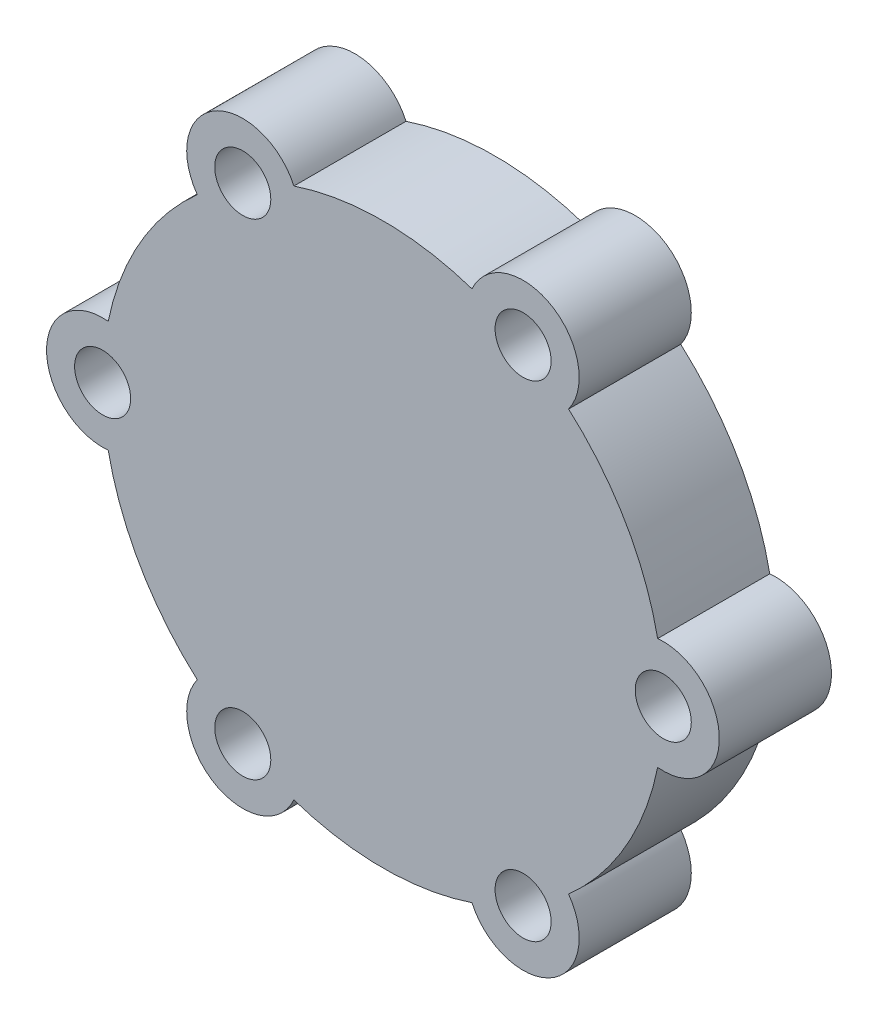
ISO-10303-21;
HEADER;
FILE_DESCRIPTION(('STEP AP214'),'2;1');
FILE_NAME('part.step','',(''),(''),'','','');
FILE_SCHEMA(('AUTOMOTIVE_DESIGN { 1 0 10303 214 1 1 1 1 }'));
ENDSEC;
DATA;
#1=APPLICATION_CONTEXT('core data for automotive mechanical design processes');
#2=APPLICATION_PROTOCOL_DEFINITION('international standard','automotive_design',2000,#1);
#3=PRODUCT_CONTEXT('',#1,'mechanical');
#4=PRODUCT('Part','Part','',(#3));
#5=PRODUCT_RELATED_PRODUCT_CATEGORY('part','',(#4));
#6=PRODUCT_DEFINITION_FORMATION('','',#4);
#7=PRODUCT_DEFINITION_CONTEXT('part definition',#1,'design');
#8=PRODUCT_DEFINITION('design','',#6,#7);
#9=PRODUCT_DEFINITION_SHAPE('','',#8);
#10=(LENGTH_UNIT() NAMED_UNIT(*) SI_UNIT(.MILLI.,.METRE.));
#11=(NAMED_UNIT(*) PLANE_ANGLE_UNIT() SI_UNIT($,.RADIAN.));
#12=(NAMED_UNIT(*) SI_UNIT($,.STERADIAN.) SOLID_ANGLE_UNIT());
#13=UNCERTAINTY_MEASURE_WITH_UNIT(LENGTH_MEASURE(1.E-05),#10,'distance_accuracy_value','');
#14=(GEOMETRIC_REPRESENTATION_CONTEXT(3) GLOBAL_UNCERTAINTY_ASSIGNED_CONTEXT((#13)) GLOBAL_UNIT_ASSIGNED_CONTEXT((#10,
#11,#12)) REPRESENTATION_CONTEXT('',''));
#15=CARTESIAN_POINT('',(0.,0.,0.));
#16=DIRECTION('',(0.,0.,1.));
#17=DIRECTION('',(1.,0.,0.));
#18=AXIS2_PLACEMENT_3D('',#15,#16,#17);
#19=CARTESIAN_POINT('',(95.,70.,20.));
#20=DIRECTION('',(0.,0.,1.));
#21=DIRECTION('',(1.,0.,0.));
#22=AXIS2_PLACEMENT_3D('',#19,#20,#21);
#23=PLANE('',#22);
#24=CARTESIAN_POINT('',(94.9999999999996,26.6987298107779,20.));
#25=DIRECTION('',(0.,0.,1.));
#26=DIRECTION('',(1.,0.,0.));
#27=AXIS2_PLACEMENT_3D('',#24,#25,#26);
#28=CIRCLE('',#27,5.);
#29=CARTESIAN_POINT('',(99.9999999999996,26.6987298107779,20.));
#30=VERTEX_POINT('',#29);
#31=EDGE_CURVE('E348',#30,#30,#28,.T.);
#32=ORIENTED_EDGE('',*,*,#31,.F.);
#33=EDGE_LOOP('',(#32));
#34=FACE_BOUND('',#33,.T.);
#35=CARTESIAN_POINT('',(95.0000000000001,113.301270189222,20.));
#36=DIRECTION('',(0.,0.,1.));
#37=DIRECTION('',(1.,0.,0.));
#38=AXIS2_PLACEMENT_3D('',#35,#36,#37);
#39=CIRCLE('',#38,5.);
#40=CARTESIAN_POINT('',(100.,113.301270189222,20.));
#41=VERTEX_POINT('',#40);
#42=EDGE_CURVE('E364',#41,#41,#39,.T.);
#43=ORIENTED_EDGE('',*,*,#42,.F.);
#44=EDGE_LOOP('',(#43));
#45=FACE_BOUND('',#44,.T.);
#46=CARTESIAN_POINT('',(20.0000000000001,69.9999999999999,20.));
#47=DIRECTION('',(0.,0.,1.));
#48=DIRECTION('',(1.,0.,0.));
#49=AXIS2_PLACEMENT_3D('',#46,#47,#48);
#50=CIRCLE('',#49,5.);
#51=CARTESIAN_POINT('',(25.0000000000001,69.9999999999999,20.));
#52=VERTEX_POINT('',#51);
#53=EDGE_CURVE('E170',#52,#52,#50,.T.);
#54=ORIENTED_EDGE('',*,*,#53,.F.);
#55=EDGE_LOOP('',(#54));
#56=FACE_BOUND('',#55,.T.);
#57=CARTESIAN_POINT('',(70.,70.,20.));
#58=DIRECTION('',(0.,0.,1.));
#59=DIRECTION('',(1.,0.,0.));
#60=AXIS2_PLACEMENT_3D('',#57,#58,#59);
#61=CIRCLE('',#60,50.);
#62=CARTESIAN_POINT('',(103.116843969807,32.5396924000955,20.));
#63=VERTEX_POINT('',#62);
#64=CARTESIAN_POINT('',(119.,60.0501256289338,20.));
#65=VERTEX_POINT('',#64);
#66=EDGE_CURVE('E200',#63,#65,#61,.T.);
#67=ORIENTED_EDGE('',*,*,#66,.T.);
#68=CARTESIAN_POINT('',(120.,70.,20.));
#69=DIRECTION('',(0.,0.,1.));
#70=DIRECTION('',(1.,0.,0.));
#71=AXIS2_PLACEMENT_3D('',#68,#69,#70);
#72=CIRCLE('',#71,9.99999999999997);
#73=CARTESIAN_POINT('',(119.,79.9498743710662,20.));
#74=VERTEX_POINT('',#73);
#75=EDGE_CURVE('E111',#65,#74,#72,.T.);
#76=ORIENTED_EDGE('',*,*,#75,.T.);
#77=CARTESIAN_POINT('',(70.,70.,20.));
#78=DIRECTION('',(0.,0.,1.));
#79=DIRECTION('',(1.,0.,0.));
#80=AXIS2_PLACEMENT_3D('',#77,#78,#79);
#81=CIRCLE('',#80,50.);
#82=CARTESIAN_POINT('',(103.116843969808,107.460307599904,20.));
#83=VERTEX_POINT('',#82);
#84=EDGE_CURVE('E238',#74,#83,#81,.T.);
#85=ORIENTED_EDGE('',*,*,#84,.T.);
#86=CARTESIAN_POINT('',(95.0000000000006,113.301270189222,20.));
#87=DIRECTION('',(0.,0.,1.));
#88=DIRECTION('',(1.,0.,0.));
#89=AXIS2_PLACEMENT_3D('',#86,#87,#88);
#90=CIRCLE('',#89,9.99999999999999);
#91=CARTESIAN_POINT('',(85.8831560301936,117.41018197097,20.));
#92=VERTEX_POINT('',#91);
#93=EDGE_CURVE('E258',#83,#92,#90,.T.);
#94=ORIENTED_EDGE('',*,*,#93,.T.);
#95=CARTESIAN_POINT('',(70.,70.,20.));
#96=DIRECTION('',(0.,0.,1.));
#97=DIRECTION('',(1.,0.,0.));
#98=AXIS2_PLACEMENT_3D('',#95,#96,#97);
#99=CIRCLE('',#98,50.);
#100=CARTESIAN_POINT('',(54.1168439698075,117.410181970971,20.));
#101=VERTEX_POINT('',#100);
#102=EDGE_CURVE('E254',#92,#101,#99,.T.);
#103=ORIENTED_EDGE('',*,*,#102,.T.);
#104=CARTESIAN_POINT('',(45.0000000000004,113.301270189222,20.));
#105=DIRECTION('',(0.,0.,1.));
#106=DIRECTION('',(1.,0.,0.));
#107=AXIS2_PLACEMENT_3D('',#104,#105,#106);
#108=CIRCLE('',#107,9.99999999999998);
#109=CARTESIAN_POINT('',(36.8831560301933,107.460307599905,20.));
#110=VERTEX_POINT('',#109);
#111=EDGE_CURVE('E257',#101,#110,#108,.T.);
#112=ORIENTED_EDGE('',*,*,#111,.T.);
#113=CARTESIAN_POINT('',(70.,70.,20.));
#114=DIRECTION('',(0.,0.,1.));
#115=DIRECTION('',(1.,0.,0.));
#116=AXIS2_PLACEMENT_3D('',#113,#114,#115);
#117=CIRCLE('',#116,50.);
#118=CARTESIAN_POINT('',(21.,79.9498743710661,20.));
#119=VERTEX_POINT('',#118);
#120=EDGE_CURVE('E263',#110,#119,#117,.T.);
#121=ORIENTED_EDGE('',*,*,#120,.T.);
#122=CARTESIAN_POINT('',(20.0000000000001,69.9999999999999,20.));
#123=DIRECTION('',(0.,0.,1.));
#124=DIRECTION('',(1.,0.,0.));
#125=AXIS2_PLACEMENT_3D('',#122,#123,#124);
#126=CIRCLE('',#125,9.99999999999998);
#127=CARTESIAN_POINT('',(21.0000000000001,60.0501256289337,20.));
#128=VERTEX_POINT('',#127);
#129=EDGE_CURVE('E270',#119,#128,#126,.T.);
#130=ORIENTED_EDGE('',*,*,#129,.T.);
#131=CARTESIAN_POINT('',(70.,70.,20.));
#132=DIRECTION('',(0.,0.,1.));
#133=DIRECTION('',(1.,0.,0.));
#134=AXIS2_PLACEMENT_3D('',#131,#132,#133);
#135=CIRCLE('',#134,50.);
#136=CARTESIAN_POINT('',(36.8831560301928,32.5396924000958,20.));
#137=VERTEX_POINT('',#136);
#138=EDGE_CURVE('E142',#128,#137,#135,.T.);
#139=ORIENTED_EDGE('',*,*,#138,.T.);
#140=CARTESIAN_POINT('',(44.9999999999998,26.6987298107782,20.));
#141=DIRECTION('',(0.,0.,1.));
#142=DIRECTION('',(1.,0.,0.));
#143=AXIS2_PLACEMENT_3D('',#140,#141,#142);
#144=CIRCLE('',#143,9.99999999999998);
#145=CARTESIAN_POINT('',(54.1168439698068,22.5898180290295,20.));
#146=VERTEX_POINT('',#145);
#147=EDGE_CURVE('E136',#137,#146,#144,.T.);
#148=ORIENTED_EDGE('',*,*,#147,.T.);
#149=CARTESIAN_POINT('',(70.,70.,20.));
#150=DIRECTION('',(0.,0.,1.));
#151=DIRECTION('',(1.,0.,0.));
#152=AXIS2_PLACEMENT_3D('',#149,#150,#151);
#153=CIRCLE('',#152,50.);
#154=CARTESIAN_POINT('',(85.8831560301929,22.5898180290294,20.));
#155=VERTEX_POINT('',#154);
#156=EDGE_CURVE('E140',#146,#155,#153,.T.);
#157=ORIENTED_EDGE('',*,*,#156,.T.);
#158=CARTESIAN_POINT('',(94.9999999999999,26.698729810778,20.));
#159=DIRECTION('',(0.,0.,1.));
#160=DIRECTION('',(1.,0.,0.));
#161=AXIS2_PLACEMENT_3D('',#158,#159,#160);
#162=CIRCLE('',#161,9.99999999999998);
#163=EDGE_CURVE('E56',#155,#63,#162,.T.);
#164=ORIENTED_EDGE('',*,*,#163,.T.);
#165=EDGE_LOOP('',(#67,#76,#85,#94,#103,#112,#121,#130,#139,#148,#157,#164));
#166=FACE_BOUND('',#165,.T.);
#167=CARTESIAN_POINT('',(45.,113.301270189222,20.));
#168=DIRECTION('',(0.,0.,1.));
#169=DIRECTION('',(1.,0.,0.));
#170=AXIS2_PLACEMENT_3D('',#167,#168,#169);
#171=CIRCLE('',#170,5.00000000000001);
#172=CARTESIAN_POINT('',(50.0000000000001,113.301270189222,20.));
#173=VERTEX_POINT('',#172);
#174=EDGE_CURVE('E372',#173,#173,#171,.T.);
#175=ORIENTED_EDGE('',*,*,#174,.F.);
#176=EDGE_LOOP('',(#175));
#177=FACE_BOUND('',#176,.T.);
#178=CARTESIAN_POINT('',(120.,69.9999999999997,20.));
#179=DIRECTION('',(0.,0.,1.));
#180=DIRECTION('',(1.,0.,0.));
#181=AXIS2_PLACEMENT_3D('',#178,#179,#180);
#182=CIRCLE('',#181,5.00000000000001);
#183=CARTESIAN_POINT('',(125.,69.9999999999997,20.));
#184=VERTEX_POINT('',#183);
#185=EDGE_CURVE('E356',#184,#184,#182,.T.);
#186=ORIENTED_EDGE('',*,*,#185,.F.);
#187=EDGE_LOOP('',(#186));
#188=FACE_BOUND('',#187,.T.);
#189=CARTESIAN_POINT('',(44.9999999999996,26.6987298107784,20.));
#190=DIRECTION('',(0.,0.,1.));
#191=DIRECTION('',(1.,0.,0.));
#192=AXIS2_PLACEMENT_3D('',#189,#190,#191);
#193=CIRCLE('',#192,5.);
#194=CARTESIAN_POINT('',(49.9999999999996,26.6987298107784,20.));
#195=VERTEX_POINT('',#194);
#196=EDGE_CURVE('E336',#195,#195,#193,.T.);
#197=ORIENTED_EDGE('',*,*,#196,.F.);
#198=EDGE_LOOP('',(#197));
#199=FACE_BOUND('',#198,.T.);
#200=ADVANCED_FACE('F38',(#34,#45,#56,#166,#177,#188,#199),#23,.T.);
#201=CARTESIAN_POINT('',(95.,70.,0.));
#202=DIRECTION('',(0.,0.,1.));
#203=DIRECTION('',(1.,0.,0.));
#204=AXIS2_PLACEMENT_3D('',#201,#202,#203);
#205=PLANE('',#204);
#206=CARTESIAN_POINT('',(70.,70.,0.));
#207=DIRECTION('',(0.,0.,1.));
#208=DIRECTION('',(1.,0.,0.));
#209=AXIS2_PLACEMENT_3D('',#206,#207,#208);
#210=CIRCLE('',#209,50.);
#211=CARTESIAN_POINT('',(103.116843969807,32.5396924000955,0.));
#212=VERTEX_POINT('',#211);
#213=CARTESIAN_POINT('',(119.,60.0501256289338,0.));
#214=VERTEX_POINT('',#213);
#215=EDGE_CURVE('E165',#212,#214,#210,.T.);
#216=ORIENTED_EDGE('',*,*,#215,.F.);
#217=CARTESIAN_POINT('',(94.9999999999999,26.698729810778,0.));
#218=DIRECTION('',(0.,0.,1.));
#219=DIRECTION('',(1.,0.,0.));
#220=AXIS2_PLACEMENT_3D('',#217,#218,#219);
#221=CIRCLE('',#220,9.99999999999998);
#222=CARTESIAN_POINT('',(85.8831560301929,22.5898180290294,0.));
#223=VERTEX_POINT('',#222);
#224=EDGE_CURVE('E103',#223,#212,#221,.T.);
#225=ORIENTED_EDGE('',*,*,#224,.F.);
#226=CARTESIAN_POINT('',(70.,70.,0.));
#227=DIRECTION('',(0.,0.,1.));
#228=DIRECTION('',(1.,0.,0.));
#229=AXIS2_PLACEMENT_3D('',#226,#227,#228);
#230=CIRCLE('',#229,50.);
#231=CARTESIAN_POINT('',(54.1168439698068,22.5898180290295,0.));
#232=VERTEX_POINT('',#231);
#233=EDGE_CURVE('E97',#232,#223,#230,.T.);
#234=ORIENTED_EDGE('',*,*,#233,.F.);
#235=CARTESIAN_POINT('',(44.9999999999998,26.6987298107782,0.));
#236=DIRECTION('',(0.,0.,1.));
#237=DIRECTION('',(1.,0.,0.));
#238=AXIS2_PLACEMENT_3D('',#235,#236,#237);
#239=CIRCLE('',#238,9.99999999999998);
#240=CARTESIAN_POINT('',(36.8831560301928,32.5396924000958,0.));
#241=VERTEX_POINT('',#240);
#242=EDGE_CURVE('E151',#241,#232,#239,.T.);
#243=ORIENTED_EDGE('',*,*,#242,.F.);
#244=CARTESIAN_POINT('',(70.,70.,0.));
#245=DIRECTION('',(0.,0.,1.));
#246=DIRECTION('',(1.,0.,0.));
#247=AXIS2_PLACEMENT_3D('',#244,#245,#246);
#248=CIRCLE('',#247,50.);
#249=CARTESIAN_POINT('',(21.0000000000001,60.0501256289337,0.));
#250=VERTEX_POINT('',#249);
#251=EDGE_CURVE('E191',#250,#241,#248,.T.);
#252=ORIENTED_EDGE('',*,*,#251,.F.);
#253=CARTESIAN_POINT('',(20.0000000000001,69.9999999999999,0.));
#254=DIRECTION('',(0.,0.,1.));
#255=DIRECTION('',(1.,0.,0.));
#256=AXIS2_PLACEMENT_3D('',#253,#254,#255);
#257=CIRCLE('',#256,9.99999999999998);
#258=CARTESIAN_POINT('',(21.,79.9498743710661,0.));
#259=VERTEX_POINT('',#258);
#260=EDGE_CURVE('E188',#259,#250,#257,.T.);
#261=ORIENTED_EDGE('',*,*,#260,.F.);
#262=CARTESIAN_POINT('',(70.,70.,0.));
#263=DIRECTION('',(0.,0.,1.));
#264=DIRECTION('',(1.,0.,0.));
#265=AXIS2_PLACEMENT_3D('',#262,#263,#264);
#266=CIRCLE('',#265,50.);
#267=CARTESIAN_POINT('',(36.8831560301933,107.460307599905,0.));
#268=VERTEX_POINT('',#267);
#269=EDGE_CURVE('E185',#268,#259,#266,.T.);
#270=ORIENTED_EDGE('',*,*,#269,.F.);
#271=CARTESIAN_POINT('',(45.0000000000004,113.301270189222,0.));
#272=DIRECTION('',(0.,0.,1.));
#273=DIRECTION('',(1.,0.,0.));
#274=AXIS2_PLACEMENT_3D('',#271,#272,#273);
#275=CIRCLE('',#274,9.99999999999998);
#276=CARTESIAN_POINT('',(54.1168439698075,117.410181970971,0.));
#277=VERTEX_POINT('',#276);
#278=EDGE_CURVE('E182',#277,#268,#275,.T.);
#279=ORIENTED_EDGE('',*,*,#278,.F.);
#280=CARTESIAN_POINT('',(70.,70.,0.));
#281=DIRECTION('',(0.,0.,1.));
#282=DIRECTION('',(1.,0.,0.));
#283=AXIS2_PLACEMENT_3D('',#280,#281,#282);
#284=CIRCLE('',#283,50.);
#285=CARTESIAN_POINT('',(85.8831560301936,117.41018197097,0.));
#286=VERTEX_POINT('',#285);
#287=EDGE_CURVE('E179',#286,#277,#284,.T.);
#288=ORIENTED_EDGE('',*,*,#287,.F.);
#289=CARTESIAN_POINT('',(95.0000000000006,113.301270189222,0.));
#290=DIRECTION('',(0.,0.,1.));
#291=DIRECTION('',(1.,0.,0.));
#292=AXIS2_PLACEMENT_3D('',#289,#290,#291);
#293=CIRCLE('',#292,9.99999999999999);
#294=CARTESIAN_POINT('',(103.116843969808,107.460307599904,0.));
#295=VERTEX_POINT('',#294);
#296=EDGE_CURVE('E176',#295,#286,#293,.T.);
#297=ORIENTED_EDGE('',*,*,#296,.F.);
#298=CARTESIAN_POINT('',(70.,70.,0.));
#299=DIRECTION('',(0.,0.,1.));
#300=DIRECTION('',(1.,0.,0.));
#301=AXIS2_PLACEMENT_3D('',#298,#299,#300);
#302=CIRCLE('',#301,50.);
#303=CARTESIAN_POINT('',(119.,79.9498743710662,0.));
#304=VERTEX_POINT('',#303);
#305=EDGE_CURVE('E173',#304,#295,#302,.T.);
#306=ORIENTED_EDGE('',*,*,#305,.F.);
#307=CARTESIAN_POINT('',(120.,70.,0.));
#308=DIRECTION('',(0.,0.,1.));
#309=DIRECTION('',(1.,0.,0.));
#310=AXIS2_PLACEMENT_3D('',#307,#308,#309);
#311=CIRCLE('',#310,9.99999999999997);
#312=EDGE_CURVE('E169',#214,#304,#311,.T.);
#313=ORIENTED_EDGE('',*,*,#312,.F.);
#314=EDGE_LOOP('',(#216,#225,#234,#243,#252,#261,#270,#279,#288,#297,#306,#313));
#315=FACE_BOUND('',#314,.T.);
#316=CARTESIAN_POINT('',(20.0000000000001,69.9999999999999,0.));
#317=DIRECTION('',(0.,0.,1.));
#318=DIRECTION('',(1.,0.,0.));
#319=AXIS2_PLACEMENT_3D('',#316,#317,#318);
#320=CIRCLE('',#319,5.);
#321=CARTESIAN_POINT('',(25.0000000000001,69.9999999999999,0.));
#322=VERTEX_POINT('',#321);
#323=EDGE_CURVE('E376',#322,#322,#320,.T.);
#324=ORIENTED_EDGE('',*,*,#323,.T.);
#325=EDGE_LOOP('',(#324));
#326=FACE_BOUND('',#325,.T.);
#327=CARTESIAN_POINT('',(45.,113.301270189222,0.));
#328=DIRECTION('',(0.,0.,1.));
#329=DIRECTION('',(1.,0.,0.));
#330=AXIS2_PLACEMENT_3D('',#327,#328,#329);
#331=CIRCLE('',#330,5.00000000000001);
#332=CARTESIAN_POINT('',(50.0000000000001,113.301270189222,0.));
#333=VERTEX_POINT('',#332);
#334=EDGE_CURVE('E368',#333,#333,#331,.T.);
#335=ORIENTED_EDGE('',*,*,#334,.T.);
#336=EDGE_LOOP('',(#335));
#337=FACE_BOUND('',#336,.T.);
#338=CARTESIAN_POINT('',(95.0000000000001,113.301270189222,0.));
#339=DIRECTION('',(0.,0.,1.));
#340=DIRECTION('',(1.,0.,0.));
#341=AXIS2_PLACEMENT_3D('',#338,#339,#340);
#342=CIRCLE('',#341,5.);
#343=CARTESIAN_POINT('',(100.,113.301270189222,0.));
#344=VERTEX_POINT('',#343);
#345=EDGE_CURVE('E360',#344,#344,#342,.T.);
#346=ORIENTED_EDGE('',*,*,#345,.T.);
#347=EDGE_LOOP('',(#346));
#348=FACE_BOUND('',#347,.T.);
#349=CARTESIAN_POINT('',(120.,69.9999999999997,0.));
#350=DIRECTION('',(0.,0.,1.));
#351=DIRECTION('',(1.,0.,0.));
#352=AXIS2_PLACEMENT_3D('',#349,#350,#351);
#353=CIRCLE('',#352,5.00000000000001);
#354=CARTESIAN_POINT('',(125.,69.9999999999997,0.));
#355=VERTEX_POINT('',#354);
#356=EDGE_CURVE('E352',#355,#355,#353,.T.);
#357=ORIENTED_EDGE('',*,*,#356,.T.);
#358=EDGE_LOOP('',(#357));
#359=FACE_BOUND('',#358,.T.);
#360=CARTESIAN_POINT('',(94.9999999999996,26.6987298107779,0.));
#361=DIRECTION('',(0.,0.,1.));
#362=DIRECTION('',(1.,0.,0.));
#363=AXIS2_PLACEMENT_3D('',#360,#361,#362);
#364=CIRCLE('',#363,5.);
#365=CARTESIAN_POINT('',(99.9999999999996,26.6987298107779,0.));
#366=VERTEX_POINT('',#365);
#367=EDGE_CURVE('E345',#366,#366,#364,.T.);
#368=ORIENTED_EDGE('',*,*,#367,.T.);
#369=EDGE_LOOP('',(#368));
#370=FACE_BOUND('',#369,.T.);
#371=CARTESIAN_POINT('',(44.9999999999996,26.6987298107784,0.));
#372=DIRECTION('',(0.,0.,1.));
#373=DIRECTION('',(1.,0.,0.));
#374=AXIS2_PLACEMENT_3D('',#371,#372,#373);
#375=CIRCLE('',#374,5.);
#376=CARTESIAN_POINT('',(49.9999999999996,26.6987298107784,0.));
#377=VERTEX_POINT('',#376);
#378=EDGE_CURVE('E339',#377,#377,#375,.T.);
#379=ORIENTED_EDGE('',*,*,#378,.T.);
#380=EDGE_LOOP('',(#379));
#381=FACE_BOUND('',#380,.T.);
#382=ADVANCED_FACE('F242',(#315,#326,#337,#348,#359,#370,#381),#205,.F.);
#383=CARTESIAN_POINT('',(70.,70.,20.));
#384=DIRECTION('',(0.,0.,-1.));
#385=DIRECTION('',(-1.,0.,0.));
#386=AXIS2_PLACEMENT_3D('',#383,#384,#385);
#387=CYLINDRICAL_SURFACE('',#386,50.);
#388=ORIENTED_EDGE('',*,*,#215,.T.);
#389=DIRECTION('',(0.,0.,-1.));
#390=VECTOR('',#389,1.);
#391=CARTESIAN_POINT('',(119.,60.0501256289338,20.));
#392=LINE('',#391,#390);
#393=EDGE_CURVE('E11',#65,#214,#392,.T.);
#394=ORIENTED_EDGE('',*,*,#393,.F.);
#395=ORIENTED_EDGE('',*,*,#66,.F.);
#396=DIRECTION('',(0.,0.,-1.));
#397=VECTOR('',#396,1.);
#398=CARTESIAN_POINT('',(103.116843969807,32.5396924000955,20.));
#399=LINE('',#398,#397);
#400=EDGE_CURVE('E161',#63,#212,#399,.T.);
#401=ORIENTED_EDGE('',*,*,#400,.T.);
#402=EDGE_LOOP('',(#388,#394,#395,#401));
#403=FACE_BOUND('',#402,.T.);
#404=ADVANCED_FACE('F40',(#403),#387,.T.);
#405=CARTESIAN_POINT('',(120.,70.,20.));
#406=DIRECTION('',(0.,0.,-1.));
#407=DIRECTION('',(-1.,0.,0.));
#408=AXIS2_PLACEMENT_3D('',#405,#406,#407);
#409=CYLINDRICAL_SURFACE('',#408,9.99999999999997);
#410=ORIENTED_EDGE('',*,*,#312,.T.);
#411=DIRECTION('',(0.,0.,-1.));
#412=VECTOR('',#411,1.);
#413=CARTESIAN_POINT('',(119.,79.9498743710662,20.));
#414=LINE('',#413,#412);
#415=EDGE_CURVE('E48',#74,#304,#414,.T.);
#416=ORIENTED_EDGE('',*,*,#415,.F.);
#417=ORIENTED_EDGE('',*,*,#75,.F.);
#418=ORIENTED_EDGE('',*,*,#393,.T.);
#419=EDGE_LOOP('',(#410,#416,#417,#418));
#420=FACE_BOUND('',#419,.T.);
#421=ADVANCED_FACE('F537',(#420),#409,.T.);
#422=CARTESIAN_POINT('',(70.,70.,20.));
#423=DIRECTION('',(0.,0.,-1.));
#424=DIRECTION('',(-1.,0.,0.));
#425=AXIS2_PLACEMENT_3D('',#422,#423,#424);
#426=CYLINDRICAL_SURFACE('',#425,50.);
#427=ORIENTED_EDGE('',*,*,#305,.T.);
#428=DIRECTION('',(0.,0.,-1.));
#429=VECTOR('',#428,1.);
#430=CARTESIAN_POINT('',(103.116843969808,107.460307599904,20.));
#431=LINE('',#430,#429);
#432=EDGE_CURVE('E227',#83,#295,#431,.T.);
#433=ORIENTED_EDGE('',*,*,#432,.F.);
#434=ORIENTED_EDGE('',*,*,#84,.F.);
#435=ORIENTED_EDGE('',*,*,#415,.T.);
#436=EDGE_LOOP('',(#427,#433,#434,#435));
#437=FACE_BOUND('',#436,.T.);
#438=ADVANCED_FACE('F236',(#437),#426,.T.);
#439=CARTESIAN_POINT('',(95.0000000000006,113.301270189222,20.));
#440=DIRECTION('',(0.,0.,-1.));
#441=DIRECTION('',(-1.,0.,0.));
#442=AXIS2_PLACEMENT_3D('',#439,#440,#441);
#443=CYLINDRICAL_SURFACE('',#442,9.99999999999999);
#444=ORIENTED_EDGE('',*,*,#296,.T.);
#445=DIRECTION('',(0.,0.,-1.));
#446=VECTOR('',#445,1.);
#447=CARTESIAN_POINT('',(85.8831560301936,117.41018197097,20.));
#448=LINE('',#447,#446);
#449=EDGE_CURVE('E223',#92,#286,#448,.T.);
#450=ORIENTED_EDGE('',*,*,#449,.F.);
#451=ORIENTED_EDGE('',*,*,#93,.F.);
#452=ORIENTED_EDGE('',*,*,#432,.T.);
#453=EDGE_LOOP('',(#444,#450,#451,#452));
#454=FACE_BOUND('',#453,.T.);
#455=ADVANCED_FACE('F248',(#454),#443,.T.);
#456=CARTESIAN_POINT('',(70.,70.,20.));
#457=DIRECTION('',(0.,0.,-1.));
#458=DIRECTION('',(-1.,0.,0.));
#459=AXIS2_PLACEMENT_3D('',#456,#457,#458);
#460=CYLINDRICAL_SURFACE('',#459,50.);
#461=ORIENTED_EDGE('',*,*,#287,.T.);
#462=DIRECTION('',(0.,0.,-1.));
#463=VECTOR('',#462,1.);
#464=CARTESIAN_POINT('',(54.1168439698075,117.410181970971,20.));
#465=LINE('',#464,#463);
#466=EDGE_CURVE('E219',#101,#277,#465,.T.);
#467=ORIENTED_EDGE('',*,*,#466,.F.);
#468=ORIENTED_EDGE('',*,*,#102,.F.);
#469=ORIENTED_EDGE('',*,*,#449,.T.);
#470=EDGE_LOOP('',(#461,#467,#468,#469));
#471=FACE_BOUND('',#470,.T.);
#472=ADVANCED_FACE('F252',(#471),#460,.T.);
#473=CARTESIAN_POINT('',(45.0000000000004,113.301270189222,20.));
#474=DIRECTION('',(0.,0.,-1.));
#475=DIRECTION('',(-1.,0.,0.));
#476=AXIS2_PLACEMENT_3D('',#473,#474,#475);
#477=CYLINDRICAL_SURFACE('',#476,9.99999999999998);
#478=ORIENTED_EDGE('',*,*,#278,.T.);
#479=DIRECTION('',(0.,0.,-1.));
#480=VECTOR('',#479,1.);
#481=CARTESIAN_POINT('',(36.8831560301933,107.460307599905,20.));
#482=LINE('',#481,#480);
#483=EDGE_CURVE('E215',#110,#268,#482,.T.);
#484=ORIENTED_EDGE('',*,*,#483,.F.);
#485=ORIENTED_EDGE('',*,*,#111,.F.);
#486=ORIENTED_EDGE('',*,*,#466,.T.);
#487=EDGE_LOOP('',(#478,#484,#485,#486));
#488=FACE_BOUND('',#487,.T.);
#489=ADVANCED_FACE('F502',(#488),#477,.T.);
#490=CARTESIAN_POINT('',(70.,70.,20.));
#491=DIRECTION('',(0.,0.,-1.));
#492=DIRECTION('',(-1.,0.,0.));
#493=AXIS2_PLACEMENT_3D('',#490,#491,#492);
#494=CYLINDRICAL_SURFACE('',#493,50.);
#495=ORIENTED_EDGE('',*,*,#269,.T.);
#496=DIRECTION('',(0.,0.,-1.));
#497=VECTOR('',#496,1.);
#498=CARTESIAN_POINT('',(21.,79.9498743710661,20.));
#499=LINE('',#498,#497);
#500=EDGE_CURVE('E211',#119,#259,#499,.T.);
#501=ORIENTED_EDGE('',*,*,#500,.F.);
#502=ORIENTED_EDGE('',*,*,#120,.F.);
#503=ORIENTED_EDGE('',*,*,#483,.T.);
#504=EDGE_LOOP('',(#495,#501,#502,#503));
#505=FACE_BOUND('',#504,.T.);
#506=ADVANCED_FACE('F493',(#505),#494,.T.);
#507=CARTESIAN_POINT('',(20.0000000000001,69.9999999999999,20.));
#508=DIRECTION('',(0.,0.,-1.));
#509=DIRECTION('',(-1.,0.,0.));
#510=AXIS2_PLACEMENT_3D('',#507,#508,#509);
#511=CYLINDRICAL_SURFACE('',#510,9.99999999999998);
#512=ORIENTED_EDGE('',*,*,#260,.T.);
#513=DIRECTION('',(0.,0.,-1.));
#514=VECTOR('',#513,1.);
#515=CARTESIAN_POINT('',(21.0000000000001,60.0501256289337,20.));
#516=LINE('',#515,#514);
#517=EDGE_CURVE('E207',#128,#250,#516,.T.);
#518=ORIENTED_EDGE('',*,*,#517,.F.);
#519=ORIENTED_EDGE('',*,*,#129,.F.);
#520=ORIENTED_EDGE('',*,*,#500,.T.);
#521=EDGE_LOOP('',(#512,#518,#519,#520));
#522=FACE_BOUND('',#521,.T.);
#523=ADVANCED_FACE('F283',(#522),#511,.T.);
#524=CARTESIAN_POINT('',(70.,70.,20.));
#525=DIRECTION('',(0.,0.,-1.));
#526=DIRECTION('',(-1.,0.,0.));
#527=AXIS2_PLACEMENT_3D('',#524,#525,#526);
#528=CYLINDRICAL_SURFACE('',#527,50.);
#529=ORIENTED_EDGE('',*,*,#251,.T.);
#530=DIRECTION('',(0.,0.,-1.));
#531=VECTOR('',#530,1.);
#532=CARTESIAN_POINT('',(36.8831560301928,32.5396924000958,20.));
#533=LINE('',#532,#531);
#534=EDGE_CURVE('E153',#137,#241,#533,.T.);
#535=ORIENTED_EDGE('',*,*,#534,.F.);
#536=ORIENTED_EDGE('',*,*,#138,.F.);
#537=ORIENTED_EDGE('',*,*,#517,.T.);
#538=EDGE_LOOP('',(#529,#535,#536,#537));
#539=FACE_BOUND('',#538,.T.);
#540=ADVANCED_FACE('F287',(#539),#528,.T.);
#541=CARTESIAN_POINT('',(44.9999999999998,26.6987298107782,20.));
#542=DIRECTION('',(0.,0.,-1.));
#543=DIRECTION('',(-1.,0.,0.));
#544=AXIS2_PLACEMENT_3D('',#541,#542,#543);
#545=CYLINDRICAL_SURFACE('',#544,9.99999999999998);
#546=ORIENTED_EDGE('',*,*,#242,.T.);
#547=DIRECTION('',(0.,0.,-1.));
#548=VECTOR('',#547,1.);
#549=CARTESIAN_POINT('',(54.1168439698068,22.5898180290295,20.));
#550=LINE('',#549,#548);
#551=EDGE_CURVE('E148',#146,#232,#550,.T.);
#552=ORIENTED_EDGE('',*,*,#551,.F.);
#553=ORIENTED_EDGE('',*,*,#147,.F.);
#554=ORIENTED_EDGE('',*,*,#534,.T.);
#555=EDGE_LOOP('',(#546,#552,#553,#554));
#556=FACE_BOUND('',#555,.T.);
#557=ADVANCED_FACE('F149',(#556),#545,.T.);
#558=CARTESIAN_POINT('',(70.,70.,20.));
#559=DIRECTION('',(0.,0.,-1.));
#560=DIRECTION('',(-1.,0.,0.));
#561=AXIS2_PLACEMENT_3D('',#558,#559,#560);
#562=CYLINDRICAL_SURFACE('',#561,50.);
#563=ORIENTED_EDGE('',*,*,#233,.T.);
#564=DIRECTION('',(0.,0.,-1.));
#565=VECTOR('',#564,1.);
#566=CARTESIAN_POINT('',(85.8831560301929,22.5898180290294,20.));
#567=LINE('',#566,#565);
#568=EDGE_CURVE('E154',#155,#223,#567,.T.);
#569=ORIENTED_EDGE('',*,*,#568,.F.);
#570=ORIENTED_EDGE('',*,*,#156,.F.);
#571=ORIENTED_EDGE('',*,*,#551,.T.);
#572=EDGE_LOOP('',(#563,#569,#570,#571));
#573=FACE_BOUND('',#572,.T.);
#574=ADVANCED_FACE('F156',(#573),#562,.T.);
#575=CARTESIAN_POINT('',(94.9999999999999,26.698729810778,20.));
#576=DIRECTION('',(0.,0.,-1.));
#577=DIRECTION('',(-1.,0.,0.));
#578=AXIS2_PLACEMENT_3D('',#575,#576,#577);
#579=CYLINDRICAL_SURFACE('',#578,9.99999999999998);
#580=ORIENTED_EDGE('',*,*,#224,.T.);
#581=ORIENTED_EDGE('',*,*,#400,.F.);
#582=ORIENTED_EDGE('',*,*,#163,.F.);
#583=ORIENTED_EDGE('',*,*,#568,.T.);
#584=EDGE_LOOP('',(#580,#581,#582,#583));
#585=FACE_BOUND('',#584,.T.);
#586=ADVANCED_FACE('F291',(#585),#579,.T.);
#587=CARTESIAN_POINT('',(20.0000000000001,69.9999999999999,20.));
#588=DIRECTION('',(0.,0.,-1.));
#589=DIRECTION('',(-1.,0.,0.));
#590=AXIS2_PLACEMENT_3D('',#587,#588,#589);
#591=CYLINDRICAL_SURFACE('',#590,5.);
#592=ORIENTED_EDGE('',*,*,#53,.T.);
#593=EDGE_LOOP('',(#592));
#594=FACE_BOUND('',#593,.T.);
#595=ORIENTED_EDGE('',*,*,#323,.F.);
#596=EDGE_LOOP('',(#595));
#597=FACE_BOUND('',#596,.T.);
#598=ADVANCED_FACE('F293',(#594,#597),#591,.F.);
#599=CARTESIAN_POINT('',(45.,113.301270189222,20.));
#600=DIRECTION('',(0.,0.,-1.));
#601=DIRECTION('',(-1.,0.,0.));
#602=AXIS2_PLACEMENT_3D('',#599,#600,#601);
#603=CYLINDRICAL_SURFACE('',#602,5.00000000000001);
#604=ORIENTED_EDGE('',*,*,#174,.T.);
#605=EDGE_LOOP('',(#604));
#606=FACE_BOUND('',#605,.T.);
#607=ORIENTED_EDGE('',*,*,#334,.F.);
#608=EDGE_LOOP('',(#607));
#609=FACE_BOUND('',#608,.T.);
#610=ADVANCED_FACE('F299',(#606,#609),#603,.F.);
#611=CARTESIAN_POINT('',(95.0000000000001,113.301270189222,20.));
#612=DIRECTION('',(0.,0.,-1.));
#613=DIRECTION('',(-1.,0.,0.));
#614=AXIS2_PLACEMENT_3D('',#611,#612,#613);
#615=CYLINDRICAL_SURFACE('',#614,5.);
#616=ORIENTED_EDGE('',*,*,#42,.T.);
#617=EDGE_LOOP('',(#616));
#618=FACE_BOUND('',#617,.T.);
#619=ORIENTED_EDGE('',*,*,#345,.F.);
#620=EDGE_LOOP('',(#619));
#621=FACE_BOUND('',#620,.T.);
#622=ADVANCED_FACE('F315',(#618,#621),#615,.F.);
#623=CARTESIAN_POINT('',(120.,69.9999999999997,20.));
#624=DIRECTION('',(0.,0.,-1.));
#625=DIRECTION('',(-1.,0.,0.));
#626=AXIS2_PLACEMENT_3D('',#623,#624,#625);
#627=CYLINDRICAL_SURFACE('',#626,5.00000000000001);
#628=ORIENTED_EDGE('',*,*,#185,.T.);
#629=EDGE_LOOP('',(#628));
#630=FACE_BOUND('',#629,.T.);
#631=ORIENTED_EDGE('',*,*,#356,.F.);
#632=EDGE_LOOP('',(#631));
#633=FACE_BOUND('',#632,.T.);
#634=ADVANCED_FACE('F319',(#630,#633),#627,.F.);
#635=CARTESIAN_POINT('',(94.9999999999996,26.6987298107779,20.));
#636=DIRECTION('',(0.,0.,-1.));
#637=DIRECTION('',(-1.,0.,0.));
#638=AXIS2_PLACEMENT_3D('',#635,#636,#637);
#639=CYLINDRICAL_SURFACE('',#638,5.);
#640=ORIENTED_EDGE('',*,*,#31,.T.);
#641=EDGE_LOOP('',(#640));
#642=FACE_BOUND('',#641,.T.);
#643=ORIENTED_EDGE('',*,*,#367,.F.);
#644=EDGE_LOOP('',(#643));
#645=FACE_BOUND('',#644,.T.);
#646=ADVANCED_FACE('F323',(#642,#645),#639,.F.);
#647=CARTESIAN_POINT('',(44.9999999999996,26.6987298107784,20.));
#648=DIRECTION('',(0.,0.,-1.));
#649=DIRECTION('',(-1.,0.,0.));
#650=AXIS2_PLACEMENT_3D('',#647,#648,#649);
#651=CYLINDRICAL_SURFACE('',#650,5.);
#652=ORIENTED_EDGE('',*,*,#196,.T.);
#653=EDGE_LOOP('',(#652));
#654=FACE_BOUND('',#653,.T.);
#655=ORIENTED_EDGE('',*,*,#378,.F.);
#656=EDGE_LOOP('',(#655));
#657=FACE_BOUND('',#656,.T.);
#658=ADVANCED_FACE('F327',(#654,#657),#651,.F.);
#659=CLOSED_SHELL('',(#200,#382,#404,#421,#438,#455,#472,#489,#506,#523,#540,#557,#574,#586,
#598,#610,#622,#634,#646,#658));
#660=MANIFOLD_SOLID_BREP('B2',#659);
#661=ADVANCED_BREP_SHAPE_REPRESENTATION('',(#18,#660),#14);
#662=SHAPE_DEFINITION_REPRESENTATION(#9,#661);
ENDSEC;
END-ISO-10303-21;
